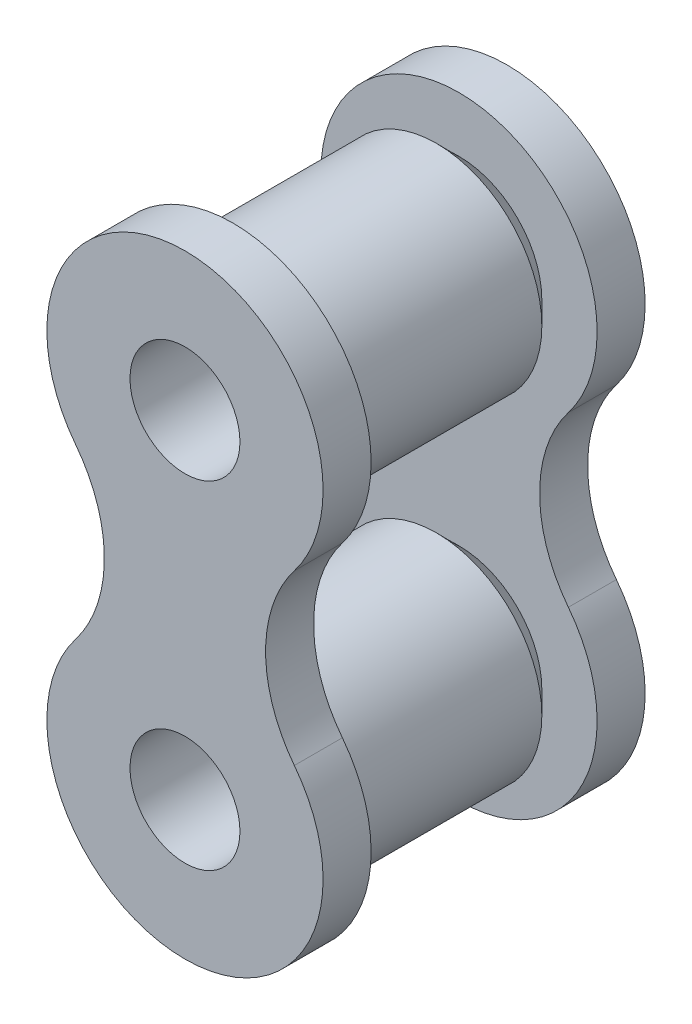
ISO-10303-21;
HEADER;
FILE_DESCRIPTION(('STEP AP214'),'2;1');
FILE_NAME('part.step','',(''),(''),'','','');
FILE_SCHEMA(('AUTOMOTIVE_DESIGN { 1 0 10303 214 1 1 1 1 }'));
ENDSEC;
DATA;
#1=APPLICATION_CONTEXT('core data for automotive mechanical design processes');
#2=APPLICATION_PROTOCOL_DEFINITION('international standard','automotive_design',2000,#1);
#3=PRODUCT_CONTEXT('',#1,'mechanical');
#4=PRODUCT('Part','Part','',(#3));
#5=PRODUCT_RELATED_PRODUCT_CATEGORY('part','',(#4));
#6=PRODUCT_DEFINITION_FORMATION('','',#4);
#7=PRODUCT_DEFINITION_CONTEXT('part definition',#1,'design');
#8=PRODUCT_DEFINITION('design','',#6,#7);
#9=PRODUCT_DEFINITION_SHAPE('','',#8);
#10=(LENGTH_UNIT() NAMED_UNIT(*) SI_UNIT(.MILLI.,.METRE.));
#11=(NAMED_UNIT(*) PLANE_ANGLE_UNIT() SI_UNIT($,.RADIAN.));
#12=(NAMED_UNIT(*) SI_UNIT($,.STERADIAN.) SOLID_ANGLE_UNIT());
#13=UNCERTAINTY_MEASURE_WITH_UNIT(LENGTH_MEASURE(1.E-05),#10,'distance_accuracy_value','');
#14=(GEOMETRIC_REPRESENTATION_CONTEXT(3) GLOBAL_UNCERTAINTY_ASSIGNED_CONTEXT((#13)) GLOBAL_UNIT_ASSIGNED_CONTEXT((#10,
#11,#12)) REPRESENTATION_CONTEXT('',''));
#15=CARTESIAN_POINT('',(0.,0.,0.));
#16=DIRECTION('',(0.,0.,1.));
#17=DIRECTION('',(1.,0.,0.));
#18=AXIS2_PLACEMENT_3D('',#15,#16,#17);
#19=CARTESIAN_POINT('',(0.,0.,-8.51));
#20=DIRECTION('',(0.,0.,1.));
#21=DIRECTION('',(1.,0.,0.));
#22=AXIS2_PLACEMENT_3D('',#19,#20,#21);
#23=PLANE('',#22);
#24=CARTESIAN_POINT('',(0.,0.,-8.51));
#25=DIRECTION('',(0.,0.,1.));
#26=DIRECTION('',(0.,1.,0.));
#27=AXIS2_PLACEMENT_3D('',#24,#25,#26);
#28=CIRCLE('',#27,6.238);
#29=CARTESIAN_POINT('',(0.,6.238,-8.51));
#30=VERTEX_POINT('',#29);
#31=EDGE_CURVE('E157',#30,#30,#28,.T.);
#32=ORIENTED_EDGE('',*,*,#31,.F.);
#33=EDGE_LOOP('',(#32));
#34=FACE_BOUND('',#33,.T.);
#35=CARTESIAN_POINT('',(-16.4727046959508,12.7,-8.51));
#36=DIRECTION('',(0.,0.,-1.));
#37=DIRECTION('',(0.,1.,0.));
#38=AXIS2_PLACEMENT_3D('',#35,#36,#37);
#39=CIRCLE('',#38,10.4);
#40=CARTESIAN_POINT('',(-8.23635234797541,19.05,-8.51));
#41=VERTEX_POINT('',#40);
#42=CARTESIAN_POINT('',(-8.23635234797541,6.35,-8.51));
#43=VERTEX_POINT('',#42);
#44=EDGE_CURVE('E37',#41,#43,#39,.T.);
#45=ORIENTED_EDGE('',*,*,#44,.T.);
#46=CARTESIAN_POINT('',(0.,0.,-8.51));
#47=DIRECTION('',(0.,0.,-1.));
#48=DIRECTION('',(0.,1.,0.));
#49=AXIS2_PLACEMENT_3D('',#46,#47,#48);
#50=CIRCLE('',#49,10.4);
#51=CARTESIAN_POINT('',(8.23635234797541,6.35,-8.51));
#52=VERTEX_POINT('',#51);
#53=EDGE_CURVE('E188',#52,#43,#50,.T.);
#54=ORIENTED_EDGE('',*,*,#53,.F.);
#55=CARTESIAN_POINT('',(16.4727046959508,12.7,-8.51));
#56=DIRECTION('',(0.,0.,-1.));
#57=DIRECTION('',(0.,1.,0.));
#58=AXIS2_PLACEMENT_3D('',#55,#56,#57);
#59=CIRCLE('',#58,10.4);
#60=CARTESIAN_POINT('',(8.2363523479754,19.05,-8.51));
#61=VERTEX_POINT('',#60);
#62=EDGE_CURVE('E169',#52,#61,#59,.T.);
#63=ORIENTED_EDGE('',*,*,#62,.T.);
#64=CARTESIAN_POINT('',(0.,25.4,-8.51));
#65=DIRECTION('',(0.,0.,-1.));
#66=DIRECTION('',(0.,1.,0.));
#67=AXIS2_PLACEMENT_3D('',#64,#65,#66);
#68=CIRCLE('',#67,10.4);
#69=EDGE_CURVE('E177',#41,#61,#68,.T.);
#70=ORIENTED_EDGE('',*,*,#69,.F.);
#71=EDGE_LOOP('',(#45,#54,#63,#70));
#72=FACE_BOUND('',#71,.T.);
#73=CARTESIAN_POINT('',(0.,25.4,-8.51));
#74=DIRECTION('',(0.,0.,1.));
#75=DIRECTION('',(0.,1.,0.));
#76=AXIS2_PLACEMENT_3D('',#73,#74,#75);
#77=CIRCLE('',#76,6.238);
#78=CARTESIAN_POINT('',(0.,31.638,-8.51));
#79=VERTEX_POINT('',#78);
#80=EDGE_CURVE('E145',#79,#79,#77,.T.);
#81=ORIENTED_EDGE('',*,*,#80,.F.);
#82=EDGE_LOOP('',(#81));
#83=FACE_BOUND('',#82,.T.);
#84=ADVANCED_FACE('F19',(#34,#72,#83),#23,.T.);
#85=CARTESIAN_POINT('',(0.,0.,-12.126));
#86=DIRECTION('',(0.,0.,-1.));
#87=DIRECTION('',(-1.,0.,0.));
#88=AXIS2_PLACEMENT_3D('',#85,#86,#87);
#89=PLANE('',#88);
#90=CARTESIAN_POINT('',(0.,25.4,-12.126));
#91=DIRECTION('',(0.,0.,-1.));
#92=DIRECTION('',(-1.,0.,0.));
#93=AXIS2_PLACEMENT_3D('',#90,#91,#92);
#94=CIRCLE('',#93,4.14);
#95=CARTESIAN_POINT('',(-4.14,25.4,-12.126));
#96=VERTEX_POINT('',#95);
#97=EDGE_CURVE('E200',#96,#96,#94,.T.);
#98=ORIENTED_EDGE('',*,*,#97,.F.);
#99=EDGE_LOOP('',(#98));
#100=FACE_BOUND('',#99,.T.);
#101=CARTESIAN_POINT('',(0.,0.,-12.126));
#102=DIRECTION('',(0.,0.,-1.));
#103=DIRECTION('',(-1.,0.,0.));
#104=AXIS2_PLACEMENT_3D('',#101,#102,#103);
#105=CIRCLE('',#104,4.14);
#106=CARTESIAN_POINT('',(-4.14,0.,-12.126));
#107=VERTEX_POINT('',#106);
#108=EDGE_CURVE('E199',#107,#107,#105,.T.);
#109=ORIENTED_EDGE('',*,*,#108,.F.);
#110=EDGE_LOOP('',(#109));
#111=FACE_BOUND('',#110,.T.);
#112=CARTESIAN_POINT('',(-16.4727046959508,12.7,-12.126));
#113=DIRECTION('',(0.,0.,1.));
#114=DIRECTION('',(0.,1.,0.));
#115=AXIS2_PLACEMENT_3D('',#112,#113,#114);
#116=CIRCLE('',#115,10.4);
#117=CARTESIAN_POINT('',(-8.23635234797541,6.35,-12.126));
#118=VERTEX_POINT('',#117);
#119=CARTESIAN_POINT('',(-8.23635234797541,19.05,-12.126));
#120=VERTEX_POINT('',#119);
#121=EDGE_CURVE('E161',#118,#120,#116,.T.);
#122=ORIENTED_EDGE('',*,*,#121,.T.);
#123=CARTESIAN_POINT('',(0.,25.4,-12.126));
#124=DIRECTION('',(0.,0.,1.));
#125=DIRECTION('',(0.,1.,0.));
#126=AXIS2_PLACEMENT_3D('',#123,#124,#125);
#127=CIRCLE('',#126,10.4);
#128=CARTESIAN_POINT('',(8.23635234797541,19.05,-12.126));
#129=VERTEX_POINT('',#128);
#130=EDGE_CURVE('E173',#129,#120,#127,.T.);
#131=ORIENTED_EDGE('',*,*,#130,.F.);
#132=CARTESIAN_POINT('',(16.4727046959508,12.7,-12.126));
#133=DIRECTION('',(0.,0.,1.));
#134=DIRECTION('',(0.,1.,0.));
#135=AXIS2_PLACEMENT_3D('',#132,#133,#134);
#136=CIRCLE('',#135,10.4);
#137=CARTESIAN_POINT('',(8.23635234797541,6.35,-12.126));
#138=VERTEX_POINT('',#137);
#139=EDGE_CURVE('E45',#129,#138,#136,.T.);
#140=ORIENTED_EDGE('',*,*,#139,.T.);
#141=CARTESIAN_POINT('',(0.,0.,-12.126));
#142=DIRECTION('',(0.,0.,1.));
#143=DIRECTION('',(0.,1.,0.));
#144=AXIS2_PLACEMENT_3D('',#141,#142,#143);
#145=CIRCLE('',#144,10.4);
#146=EDGE_CURVE('E184',#118,#138,#145,.T.);
#147=ORIENTED_EDGE('',*,*,#146,.F.);
#148=EDGE_LOOP('',(#122,#131,#140,#147));
#149=FACE_BOUND('',#148,.T.);
#150=ADVANCED_FACE('F253',(#100,#111,#149),#89,.T.);
#151=CARTESIAN_POINT('',(0.,0.,-12.126));
#152=DIRECTION('',(0.,0.,1.));
#153=DIRECTION('',(0.,1.,0.));
#154=AXIS2_PLACEMENT_3D('',#151,#152,#153);
#155=CYLINDRICAL_SURFACE('',#154,10.4);
#156=DIRECTION('',(0.,0.,1.));
#157=VECTOR('',#156,1.);
#158=CARTESIAN_POINT('',(-8.23635234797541,6.35,-12.126));
#159=LINE('',#158,#157);
#160=EDGE_CURVE('E29',#118,#43,#159,.T.);
#161=ORIENTED_EDGE('',*,*,#160,.F.);
#162=ORIENTED_EDGE('',*,*,#146,.T.);
#163=DIRECTION('',(0.,0.,1.));
#164=VECTOR('',#163,1.);
#165=CARTESIAN_POINT('',(8.23635234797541,6.35,-12.126));
#166=LINE('',#165,#164);
#167=EDGE_CURVE('E192',#52,#138,#166,.F.);
#168=ORIENTED_EDGE('',*,*,#167,.F.);
#169=ORIENTED_EDGE('',*,*,#53,.T.);
#170=EDGE_LOOP('',(#161,#162,#168,#169));
#171=FACE_BOUND('',#170,.T.);
#172=ADVANCED_FACE('F21',(#171),#155,.T.);
#173=CARTESIAN_POINT('',(0.,25.4,-12.126));
#174=DIRECTION('',(0.,0.,1.));
#175=DIRECTION('',(0.,1.,0.));
#176=AXIS2_PLACEMENT_3D('',#173,#174,#175);
#177=CYLINDRICAL_SURFACE('',#176,10.4);
#178=ORIENTED_EDGE('',*,*,#130,.T.);
#179=DIRECTION('',(0.,0.,1.));
#180=VECTOR('',#179,1.);
#181=CARTESIAN_POINT('',(-8.23635234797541,19.05,-12.126));
#182=LINE('',#181,#180);
#183=EDGE_CURVE('E181',#120,#41,#182,.T.);
#184=ORIENTED_EDGE('',*,*,#183,.T.);
#185=ORIENTED_EDGE('',*,*,#69,.T.);
#186=DIRECTION('',(0.,0.,1.));
#187=VECTOR('',#186,1.);
#188=CARTESIAN_POINT('',(8.23635234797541,19.05,-12.126));
#189=LINE('',#188,#187);
#190=EDGE_CURVE('E11',#61,#129,#189,.F.);
#191=ORIENTED_EDGE('',*,*,#190,.T.);
#192=EDGE_LOOP('',(#178,#184,#185,#191));
#193=FACE_BOUND('',#192,.T.);
#194=ADVANCED_FACE('F264',(#193),#177,.T.);
#195=CARTESIAN_POINT('',(16.4727046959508,12.7,-12.126));
#196=DIRECTION('',(0.,0.,1.));
#197=DIRECTION('',(0.,1.,0.));
#198=AXIS2_PLACEMENT_3D('',#195,#196,#197);
#199=CYLINDRICAL_SURFACE('',#198,10.4);
#200=ORIENTED_EDGE('',*,*,#167,.T.);
#201=ORIENTED_EDGE('',*,*,#139,.F.);
#202=ORIENTED_EDGE('',*,*,#190,.F.);
#203=ORIENTED_EDGE('',*,*,#62,.F.);
#204=EDGE_LOOP('',(#200,#201,#202,#203));
#205=FACE_BOUND('',#204,.T.);
#206=ADVANCED_FACE('F267',(#205),#199,.F.);
#207=CARTESIAN_POINT('',(-16.4727046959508,12.7,-12.126));
#208=DIRECTION('',(0.,0.,1.));
#209=DIRECTION('',(0.,1.,0.));
#210=AXIS2_PLACEMENT_3D('',#207,#208,#209);
#211=CYLINDRICAL_SURFACE('',#210,10.4);
#212=ORIENTED_EDGE('',*,*,#160,.T.);
#213=ORIENTED_EDGE('',*,*,#44,.F.);
#214=ORIENTED_EDGE('',*,*,#183,.F.);
#215=ORIENTED_EDGE('',*,*,#121,.F.);
#216=EDGE_LOOP('',(#212,#213,#214,#215));
#217=FACE_BOUND('',#216,.T.);
#218=ADVANCED_FACE('F271',(#217),#211,.F.);
#219=CARTESIAN_POINT('',(0.,0.,-6.808));
#220=DIRECTION('',(0.,0.,1.));
#221=DIRECTION('',(0.,1.,0.));
#222=AXIS2_PLACEMENT_3D('',#219,#220,#221);
#223=CYLINDRICAL_SURFACE('',#222,7.94);
#224=CARTESIAN_POINT('',(0.,0.,6.808));
#225=DIRECTION('',(0.,0.,1.));
#226=DIRECTION('',(1.,0.,0.));
#227=AXIS2_PLACEMENT_3D('',#224,#225,#226);
#228=CIRCLE('',#227,7.94);
#229=CARTESIAN_POINT('',(7.94,0.,6.808));
#230=VERTEX_POINT('',#229);
#231=EDGE_CURVE('E149',#230,#230,#228,.T.);
#232=ORIENTED_EDGE('',*,*,#231,.F.);
#233=EDGE_LOOP('',(#232));
#234=FACE_BOUND('',#233,.T.);
#235=CARTESIAN_POINT('',(0.,0.,-6.808));
#236=DIRECTION('',(0.,0.,-1.));
#237=DIRECTION('',(-1.,0.,0.));
#238=AXIS2_PLACEMENT_3D('',#235,#236,#237);
#239=CIRCLE('',#238,7.94);
#240=CARTESIAN_POINT('',(-7.94,0.,-6.808));
#241=VERTEX_POINT('',#240);
#242=EDGE_CURVE('E153',#241,#241,#239,.T.);
#243=ORIENTED_EDGE('',*,*,#242,.F.);
#244=EDGE_LOOP('',(#243));
#245=FACE_BOUND('',#244,.T.);
#246=ADVANCED_FACE('F274',(#234,#245),#223,.T.);
#247=CARTESIAN_POINT('',(0.,0.,-6.808));
#248=DIRECTION('',(0.,0.,1.));
#249=DIRECTION('',(1.,0.,0.));
#250=AXIS2_PLACEMENT_3D('',#247,#248,#249);
#251=CONICAL_SURFACE('',#250,7.94,0.785398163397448);
#252=ORIENTED_EDGE('',*,*,#31,.T.);
#253=EDGE_LOOP('',(#252));
#254=FACE_BOUND('',#253,.T.);
#255=ORIENTED_EDGE('',*,*,#242,.T.);
#256=EDGE_LOOP('',(#255));
#257=FACE_BOUND('',#256,.T.);
#258=ADVANCED_FACE('F277',(#254,#257),#251,.T.);
#259=CARTESIAN_POINT('',(0.,0.,6.808));
#260=DIRECTION('',(0.,0.,-1.));
#261=DIRECTION('',(-1.,0.,0.));
#262=AXIS2_PLACEMENT_3D('',#259,#260,#261);
#263=CONICAL_SURFACE('',#262,7.94,0.785398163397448);
#264=CARTESIAN_POINT('',(0.,0.,8.51));
#265=DIRECTION('',(0.,0.,-1.));
#266=DIRECTION('',(-1.,0.,0.));
#267=AXIS2_PLACEMENT_3D('',#264,#265,#266);
#268=CIRCLE('',#267,6.238);
#269=CARTESIAN_POINT('',(-6.238,0.,8.51));
#270=VERTEX_POINT('',#269);
#271=EDGE_CURVE('E133',#270,#270,#268,.T.);
#272=ORIENTED_EDGE('',*,*,#271,.T.);
#273=EDGE_LOOP('',(#272));
#274=FACE_BOUND('',#273,.T.);
#275=ORIENTED_EDGE('',*,*,#231,.T.);
#276=EDGE_LOOP('',(#275));
#277=FACE_BOUND('',#276,.T.);
#278=ADVANCED_FACE('F281',(#274,#277),#263,.T.);
#279=CARTESIAN_POINT('',(0.,25.4,-6.808));
#280=DIRECTION('',(0.,0.,1.));
#281=DIRECTION('',(0.,1.,0.));
#282=AXIS2_PLACEMENT_3D('',#279,#280,#281);
#283=CYLINDRICAL_SURFACE('',#282,7.94);
#284=CARTESIAN_POINT('',(0.,25.4,6.808));
#285=DIRECTION('',(0.,0.,1.));
#286=DIRECTION('',(1.,0.,0.));
#287=AXIS2_PLACEMENT_3D('',#284,#285,#286);
#288=CIRCLE('',#287,7.94);
#289=CARTESIAN_POINT('',(7.94,25.4,6.808));
#290=VERTEX_POINT('',#289);
#291=EDGE_CURVE('E137',#290,#290,#288,.T.);
#292=ORIENTED_EDGE('',*,*,#291,.F.);
#293=EDGE_LOOP('',(#292));
#294=FACE_BOUND('',#293,.T.);
#295=CARTESIAN_POINT('',(0.,25.4,-6.808));
#296=DIRECTION('',(0.,0.,-1.));
#297=DIRECTION('',(-1.,0.,0.));
#298=AXIS2_PLACEMENT_3D('',#295,#296,#297);
#299=CIRCLE('',#298,7.94);
#300=CARTESIAN_POINT('',(-7.94,25.4,-6.808));
#301=VERTEX_POINT('',#300);
#302=EDGE_CURVE('E141',#301,#301,#299,.T.);
#303=ORIENTED_EDGE('',*,*,#302,.F.);
#304=EDGE_LOOP('',(#303));
#305=FACE_BOUND('',#304,.T.);
#306=ADVANCED_FACE('F285',(#294,#305),#283,.T.);
#307=CARTESIAN_POINT('',(0.,25.4,-6.808));
#308=DIRECTION('',(0.,0.,1.));
#309=DIRECTION('',(1.,0.,0.));
#310=AXIS2_PLACEMENT_3D('',#307,#308,#309);
#311=CONICAL_SURFACE('',#310,7.94,0.785398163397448);
#312=ORIENTED_EDGE('',*,*,#80,.T.);
#313=EDGE_LOOP('',(#312));
#314=FACE_BOUND('',#313,.T.);
#315=ORIENTED_EDGE('',*,*,#302,.T.);
#316=EDGE_LOOP('',(#315));
#317=FACE_BOUND('',#316,.T.);
#318=ADVANCED_FACE('F289',(#314,#317),#311,.T.);
#319=CARTESIAN_POINT('',(0.,25.4,6.808));
#320=DIRECTION('',(0.,0.,-1.));
#321=DIRECTION('',(-1.,0.,0.));
#322=AXIS2_PLACEMENT_3D('',#319,#320,#321);
#323=CONICAL_SURFACE('',#322,7.94,0.785398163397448);
#324=CARTESIAN_POINT('',(0.,25.4,8.51));
#325=DIRECTION('',(0.,0.,-1.));
#326=DIRECTION('',(-1.,0.,0.));
#327=AXIS2_PLACEMENT_3D('',#324,#325,#326);
#328=CIRCLE('',#327,6.238);
#329=CARTESIAN_POINT('',(-6.238,25.4,8.51));
#330=VERTEX_POINT('',#329);
#331=EDGE_CURVE('E129',#330,#330,#328,.T.);
#332=ORIENTED_EDGE('',*,*,#331,.T.);
#333=EDGE_LOOP('',(#332));
#334=FACE_BOUND('',#333,.T.);
#335=ORIENTED_EDGE('',*,*,#291,.T.);
#336=EDGE_LOOP('',(#335));
#337=FACE_BOUND('',#336,.T.);
#338=ADVANCED_FACE('F293',(#334,#337),#323,.T.);
#339=CARTESIAN_POINT('',(0.,0.,8.51));
#340=DIRECTION('',(0.,0.,-1.));
#341=DIRECTION('',(-1.,0.,0.));
#342=AXIS2_PLACEMENT_3D('',#339,#340,#341);
#343=PLANE('',#342);
#344=ORIENTED_EDGE('',*,*,#331,.F.);
#345=EDGE_LOOP('',(#344));
#346=FACE_BOUND('',#345,.T.);
#347=CARTESIAN_POINT('',(-16.4727046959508,12.7,8.51));
#348=DIRECTION('',(0.,0.,1.));
#349=DIRECTION('',(0.,1.,0.));
#350=AXIS2_PLACEMENT_3D('',#347,#348,#349);
#351=CIRCLE('',#350,10.4);
#352=CARTESIAN_POINT('',(-8.23635234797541,6.35,8.51));
#353=VERTEX_POINT('',#352);
#354=CARTESIAN_POINT('',(-8.23635234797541,19.05,8.51));
#355=VERTEX_POINT('',#354);
#356=EDGE_CURVE('E91',#353,#355,#351,.T.);
#357=ORIENTED_EDGE('',*,*,#356,.T.);
#358=CARTESIAN_POINT('',(0.,25.4,8.51));
#359=DIRECTION('',(0.,0.,1.));
#360=DIRECTION('',(0.,1.,0.));
#361=AXIS2_PLACEMENT_3D('',#358,#359,#360);
#362=CIRCLE('',#361,10.4);
#363=CARTESIAN_POINT('',(8.23635234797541,19.05,8.51));
#364=VERTEX_POINT('',#363);
#365=EDGE_CURVE('E226',#364,#355,#362,.T.);
#366=ORIENTED_EDGE('',*,*,#365,.F.);
#367=CARTESIAN_POINT('',(16.4727046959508,12.7,8.51));
#368=DIRECTION('',(0.,0.,1.));
#369=DIRECTION('',(0.,1.,0.));
#370=AXIS2_PLACEMENT_3D('',#367,#368,#369);
#371=CIRCLE('',#370,10.4);
#372=CARTESIAN_POINT('',(8.23635234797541,6.35,8.51));
#373=VERTEX_POINT('',#372);
#374=EDGE_CURVE('E109',#364,#373,#371,.T.);
#375=ORIENTED_EDGE('',*,*,#374,.T.);
#376=CARTESIAN_POINT('',(0.,0.,8.51));
#377=DIRECTION('',(0.,0.,1.));
#378=DIRECTION('',(0.,1.,0.));
#379=AXIS2_PLACEMENT_3D('',#376,#377,#378);
#380=CIRCLE('',#379,10.4);
#381=EDGE_CURVE('E114',#353,#373,#380,.T.);
#382=ORIENTED_EDGE('',*,*,#381,.F.);
#383=EDGE_LOOP('',(#357,#366,#375,#382));
#384=FACE_BOUND('',#383,.T.);
#385=ORIENTED_EDGE('',*,*,#271,.F.);
#386=EDGE_LOOP('',(#385));
#387=FACE_BOUND('',#386,.T.);
#388=ADVANCED_FACE('F238',(#346,#384,#387),#343,.T.);
#389=CARTESIAN_POINT('',(0.,0.,12.126));
#390=DIRECTION('',(0.,0.,1.));
#391=DIRECTION('',(1.,0.,0.));
#392=AXIS2_PLACEMENT_3D('',#389,#390,#391);
#393=PLANE('',#392);
#394=CARTESIAN_POINT('',(0.,25.4,12.126));
#395=DIRECTION('',(0.,0.,1.));
#396=DIRECTION('',(1.,0.,0.));
#397=AXIS2_PLACEMENT_3D('',#394,#395,#396);
#398=CIRCLE('',#397,4.14);
#399=CARTESIAN_POINT('',(4.14,25.4,12.126));
#400=VERTEX_POINT('',#399);
#401=EDGE_CURVE('E23',#400,#400,#398,.T.);
#402=ORIENTED_EDGE('',*,*,#401,.F.);
#403=EDGE_LOOP('',(#402));
#404=FACE_BOUND('',#403,.T.);
#405=CARTESIAN_POINT('',(0.,0.,12.126));
#406=DIRECTION('',(0.,0.,1.));
#407=DIRECTION('',(1.,0.,0.));
#408=AXIS2_PLACEMENT_3D('',#405,#406,#407);
#409=CIRCLE('',#408,4.14);
#410=CARTESIAN_POINT('',(4.14,0.,12.126));
#411=VERTEX_POINT('',#410);
#412=EDGE_CURVE('E196',#411,#411,#409,.T.);
#413=ORIENTED_EDGE('',*,*,#412,.F.);
#414=EDGE_LOOP('',(#413));
#415=FACE_BOUND('',#414,.T.);
#416=CARTESIAN_POINT('',(-16.4727046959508,12.7,12.126));
#417=DIRECTION('',(0.,0.,-1.));
#418=DIRECTION('',(0.,1.,0.));
#419=AXIS2_PLACEMENT_3D('',#416,#417,#418);
#420=CIRCLE('',#419,10.4);
#421=CARTESIAN_POINT('',(-8.23635234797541,19.05,12.126));
#422=VERTEX_POINT('',#421);
#423=CARTESIAN_POINT('',(-8.23635234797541,6.35,12.126));
#424=VERTEX_POINT('',#423);
#425=EDGE_CURVE('E88',#422,#424,#420,.T.);
#426=ORIENTED_EDGE('',*,*,#425,.T.);
#427=CARTESIAN_POINT('',(0.,0.,12.126));
#428=DIRECTION('',(0.,0.,-1.));
#429=DIRECTION('',(0.,1.,0.));
#430=AXIS2_PLACEMENT_3D('',#427,#428,#429);
#431=CIRCLE('',#430,10.4);
#432=CARTESIAN_POINT('',(8.23635234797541,6.35,12.126));
#433=VERTEX_POINT('',#432);
#434=EDGE_CURVE('E105',#433,#424,#431,.T.);
#435=ORIENTED_EDGE('',*,*,#434,.F.);
#436=CARTESIAN_POINT('',(16.4727046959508,12.7,12.126));
#437=DIRECTION('',(0.,0.,-1.));
#438=DIRECTION('',(0.,1.,0.));
#439=AXIS2_PLACEMENT_3D('',#436,#437,#438);
#440=CIRCLE('',#439,10.4);
#441=CARTESIAN_POINT('',(8.2363523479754,19.05,12.126));
#442=VERTEX_POINT('',#441);
#443=EDGE_CURVE('E224',#433,#442,#440,.T.);
#444=ORIENTED_EDGE('',*,*,#443,.T.);
#445=CARTESIAN_POINT('',(0.,25.4,12.126));
#446=DIRECTION('',(0.,0.,-1.));
#447=DIRECTION('',(0.,1.,0.));
#448=AXIS2_PLACEMENT_3D('',#445,#446,#447);
#449=CIRCLE('',#448,10.4);
#450=EDGE_CURVE('E107',#422,#442,#449,.T.);
#451=ORIENTED_EDGE('',*,*,#450,.F.);
#452=EDGE_LOOP('',(#426,#435,#444,#451));
#453=FACE_BOUND('',#452,.T.);
#454=ADVANCED_FACE('F103',(#404,#415,#453),#393,.T.);
#455=CARTESIAN_POINT('',(0.,0.,8.51));
#456=DIRECTION('',(0.,0.,1.));
#457=DIRECTION('',(0.,1.,0.));
#458=AXIS2_PLACEMENT_3D('',#455,#456,#457);
#459=CYLINDRICAL_SURFACE('',#458,10.4);
#460=DIRECTION('',(0.,0.,1.));
#461=VECTOR('',#460,1.);
#462=CARTESIAN_POINT('',(-8.23635234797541,6.35,8.51));
#463=LINE('',#462,#461);
#464=EDGE_CURVE('E85',#353,#424,#463,.T.);
#465=ORIENTED_EDGE('',*,*,#464,.F.);
#466=ORIENTED_EDGE('',*,*,#381,.T.);
#467=DIRECTION('',(0.,0.,1.));
#468=VECTOR('',#467,1.);
#469=CARTESIAN_POINT('',(8.23635234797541,6.35,8.51));
#470=LINE('',#469,#468);
#471=EDGE_CURVE('E98',#433,#373,#470,.F.);
#472=ORIENTED_EDGE('',*,*,#471,.F.);
#473=ORIENTED_EDGE('',*,*,#434,.T.);
#474=EDGE_LOOP('',(#465,#466,#472,#473));
#475=FACE_BOUND('',#474,.T.);
#476=ADVANCED_FACE('F112',(#475),#459,.T.);
#477=CARTESIAN_POINT('',(0.,25.4,8.51));
#478=DIRECTION('',(0.,0.,1.));
#479=DIRECTION('',(0.,1.,0.));
#480=AXIS2_PLACEMENT_3D('',#477,#478,#479);
#481=CYLINDRICAL_SURFACE('',#480,10.4);
#482=ORIENTED_EDGE('',*,*,#365,.T.);
#483=DIRECTION('',(0.,0.,1.));
#484=VECTOR('',#483,1.);
#485=CARTESIAN_POINT('',(-8.23635234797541,19.05,8.51));
#486=LINE('',#485,#484);
#487=EDGE_CURVE('E122',#355,#422,#486,.T.);
#488=ORIENTED_EDGE('',*,*,#487,.T.);
#489=ORIENTED_EDGE('',*,*,#450,.T.);
#490=DIRECTION('',(0.,0.,1.));
#491=VECTOR('',#490,1.);
#492=CARTESIAN_POINT('',(8.23635234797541,19.05,8.51));
#493=LINE('',#492,#491);
#494=EDGE_CURVE('E97',#442,#364,#493,.F.);
#495=ORIENTED_EDGE('',*,*,#494,.T.);
#496=EDGE_LOOP('',(#482,#488,#489,#495));
#497=FACE_BOUND('',#496,.T.);
#498=ADVANCED_FACE('F235',(#497),#481,.T.);
#499=CARTESIAN_POINT('',(16.4727046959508,12.7,8.51));
#500=DIRECTION('',(0.,0.,1.));
#501=DIRECTION('',(0.,1.,0.));
#502=AXIS2_PLACEMENT_3D('',#499,#500,#501);
#503=CYLINDRICAL_SURFACE('',#502,10.4);
#504=ORIENTED_EDGE('',*,*,#471,.T.);
#505=ORIENTED_EDGE('',*,*,#374,.F.);
#506=ORIENTED_EDGE('',*,*,#494,.F.);
#507=ORIENTED_EDGE('',*,*,#443,.F.);
#508=EDGE_LOOP('',(#504,#505,#506,#507));
#509=FACE_BOUND('',#508,.T.);
#510=ADVANCED_FACE('F241',(#509),#503,.F.);
#511=CARTESIAN_POINT('',(-16.4727046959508,12.7,8.51));
#512=DIRECTION('',(0.,0.,1.));
#513=DIRECTION('',(0.,1.,0.));
#514=AXIS2_PLACEMENT_3D('',#511,#512,#513);
#515=CYLINDRICAL_SURFACE('',#514,10.4);
#516=ORIENTED_EDGE('',*,*,#464,.T.);
#517=ORIENTED_EDGE('',*,*,#425,.F.);
#518=ORIENTED_EDGE('',*,*,#487,.F.);
#519=ORIENTED_EDGE('',*,*,#356,.F.);
#520=EDGE_LOOP('',(#516,#517,#518,#519));
#521=FACE_BOUND('',#520,.T.);
#522=ADVANCED_FACE('F87',(#521),#515,.F.);
#523=CARTESIAN_POINT('',(0.,0.,-17.55));
#524=DIRECTION('',(0.,0.,1.));
#525=DIRECTION('',(0.,1.,0.));
#526=AXIS2_PLACEMENT_3D('',#523,#524,#525);
#527=CYLINDRICAL_SURFACE('',#526,4.14);
#528=ORIENTED_EDGE('',*,*,#108,.T.);
#529=EDGE_LOOP('',(#528));
#530=FACE_BOUND('',#529,.T.);
#531=ORIENTED_EDGE('',*,*,#412,.T.);
#532=EDGE_LOOP('',(#531));
#533=FACE_BOUND('',#532,.T.);
#534=ADVANCED_FACE('F249',(#530,#533),#527,.F.);
#535=CARTESIAN_POINT('',(0.,25.4,-17.55));
#536=DIRECTION('',(0.,0.,1.));
#537=DIRECTION('',(0.,1.,0.));
#538=AXIS2_PLACEMENT_3D('',#535,#536,#537);
#539=CYLINDRICAL_SURFACE('',#538,4.14);
#540=ORIENTED_EDGE('',*,*,#97,.T.);
#541=EDGE_LOOP('',(#540));
#542=FACE_BOUND('',#541,.T.);
#543=ORIENTED_EDGE('',*,*,#401,.T.);
#544=EDGE_LOOP('',(#543));
#545=FACE_BOUND('',#544,.T.);
#546=ADVANCED_FACE('F355',(#542,#545),#539,.F.);
#547=CLOSED_SHELL('',(#84,#150,#172,#194,#206,#218,#246,#258,#278,#306,#318,#338,#388,#454,#476,
#498,#510,#522,#534,#546));
#548=MANIFOLD_SOLID_BREP('B1',#547);
#549=ADVANCED_BREP_SHAPE_REPRESENTATION('',(#18,#548),#14);
#550=SHAPE_DEFINITION_REPRESENTATION(#9,#549);
ENDSEC;
END-ISO-10303-21;
